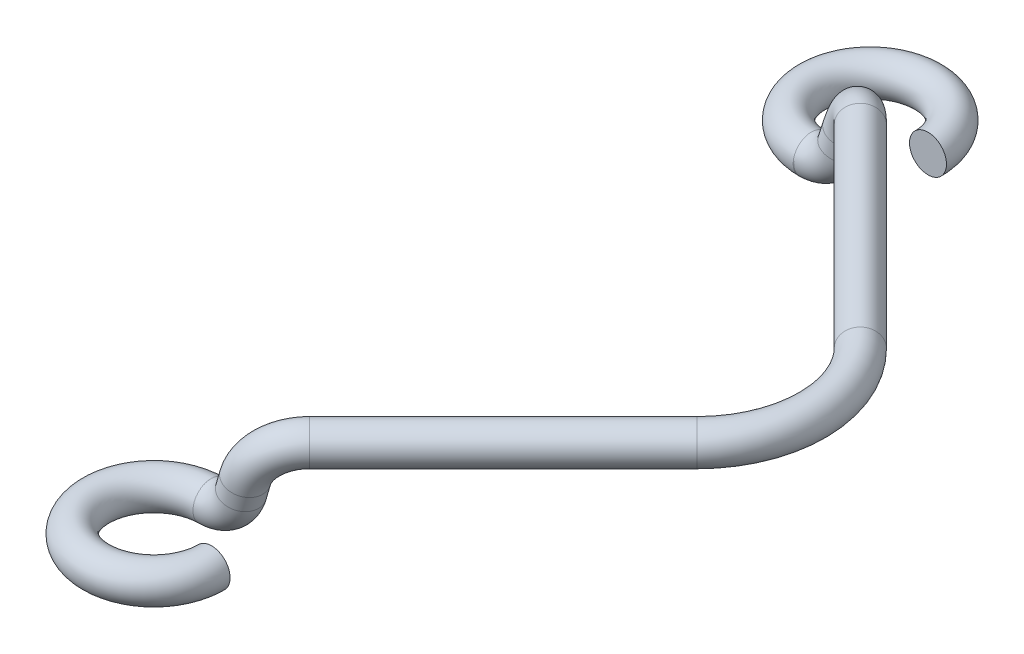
ISO-10303-21;
HEADER;
FILE_DESCRIPTION(('STEP AP214'),'2;1');
FILE_NAME('part.step','',(''),(''),'','','');
FILE_SCHEMA(('AUTOMOTIVE_DESIGN { 1 0 10303 214 1 1 1 1 }'));
ENDSEC;
DATA;
#1=APPLICATION_CONTEXT('core data for automotive mechanical design processes');
#2=APPLICATION_PROTOCOL_DEFINITION('international standard','automotive_design',2000,#1);
#3=PRODUCT_CONTEXT('',#1,'mechanical');
#4=PRODUCT('Part','Part','',(#3));
#5=PRODUCT_RELATED_PRODUCT_CATEGORY('part','',(#4));
#6=PRODUCT_DEFINITION_FORMATION('','',#4);
#7=PRODUCT_DEFINITION_CONTEXT('part definition',#1,'design');
#8=PRODUCT_DEFINITION('design','',#6,#7);
#9=PRODUCT_DEFINITION_SHAPE('','',#8);
#10=(LENGTH_UNIT() NAMED_UNIT(*) SI_UNIT(.MILLI.,.METRE.));
#11=(NAMED_UNIT(*) PLANE_ANGLE_UNIT() SI_UNIT($,.RADIAN.));
#12=(NAMED_UNIT(*) SI_UNIT($,.STERADIAN.) SOLID_ANGLE_UNIT());
#13=UNCERTAINTY_MEASURE_WITH_UNIT(LENGTH_MEASURE(1.E-05),#10,'distance_accuracy_value','');
#14=(GEOMETRIC_REPRESENTATION_CONTEXT(3) GLOBAL_UNCERTAINTY_ASSIGNED_CONTEXT((#13)) GLOBAL_UNIT_ASSIGNED_CONTEXT((#10,
#11,#12)) REPRESENTATION_CONTEXT('',''));
#15=CARTESIAN_POINT('',(0.,0.,0.));
#16=DIRECTION('',(0.,0.,1.));
#17=DIRECTION('',(1.,0.,0.));
#18=AXIS2_PLACEMENT_3D('',#15,#16,#17);
#19=CARTESIAN_POINT('',(-13.5,-1.60000000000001,-15.4999999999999));
#20=DIRECTION('',(0.,0.,1.));
#21=DIRECTION('',(1.,0.,0.));
#22=AXIS2_PLACEMENT_3D('',#19,#20,#21);
#23=PLANE('',#22);
#24=CARTESIAN_POINT('',(-14.3,-1.60000000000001,-15.5));
#25=CARTESIAN_POINT('',(-14.2999963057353,-1.5550895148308,-15.5));
#26=CARTESIAN_POINT('',(-14.2962042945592,-1.51013827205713,-15.5));
#27=CARTESIAN_POINT('',(-14.2811184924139,-1.42143511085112,-15.5));
#28=CARTESIAN_POINT('',(-14.2698086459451,-1.37768596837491,-15.5));
#29=CARTESIAN_POINT('',(-14.2400135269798,-1.29275099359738,-15.5));
#30=CARTESIAN_POINT('',(-14.2215360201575,-1.25156244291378,-15.5));
#31=CARTESIAN_POINT('',(-14.1779278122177,-1.17287261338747,-15.4999999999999));
#32=CARTESIAN_POINT('',(-14.1527969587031,-1.13537141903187,-15.4999999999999));
#33=CARTESIAN_POINT('',(-14.0965975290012,-1.0651219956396,-15.4999999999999));
#34=CARTESIAN_POINT('',(-14.0655292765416,-1.03237350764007,-15.4999999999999));
#35=CARTESIAN_POINT('',(-13.9983330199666,-0.972554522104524,-15.4999999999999));
#36=CARTESIAN_POINT('',(-13.9622045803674,-0.945484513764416,-15.4999999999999));
#37=CARTESIAN_POINT('',(-13.8859171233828,-0.897795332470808,-15.4999999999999));
#38=CARTESIAN_POINT('',(-13.8457582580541,-0.877175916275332,-15.4999999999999));
#39=CARTESIAN_POINT('',(-13.762549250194,-0.842972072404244,-15.4999999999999));
#40=CARTESIAN_POINT('',(-13.7194991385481,-0.829387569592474,-15.4999999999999));
#41=CARTESIAN_POINT('',(-13.6317290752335,-0.809638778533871,-15.4999999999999));
#42=CARTESIAN_POINT('',(-13.5870091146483,-0.803474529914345,-15.4999999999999));
#43=CARTESIAN_POINT('',(-13.4971690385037,-0.798741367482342,-15.4999999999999));
#44=CARTESIAN_POINT('',(-13.4520489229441,-0.800172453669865,-15.4999999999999));
#45=CARTESIAN_POINT('',(-13.3626896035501,-0.810589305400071,-15.4999999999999));
#46=CARTESIAN_POINT('',(-13.3184503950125,-0.819575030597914,-15.4999999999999));
#47=CARTESIAN_POINT('',(-13.2321079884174,-0.84484617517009,-15.4999999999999));
#48=CARTESIAN_POINT('',(-13.1900048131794,-0.861131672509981,-15.4999999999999));
#49=CARTESIAN_POINT('',(-13.10912864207,-0.900540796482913,-15.4999999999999));
#50=CARTESIAN_POINT('',(-13.0703557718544,-0.923664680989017,-15.4999999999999));
#51=CARTESIAN_POINT('',(-12.9972459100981,-0.976091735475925,-15.4999999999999));
#52=CARTESIAN_POINT('',(-12.9629085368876,-1.00539437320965,-15.4999999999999));
#53=CARTESIAN_POINT('',(-12.8996386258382,-1.06934963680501,-15.4999999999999));
#54=CARTESIAN_POINT('',(-12.8707063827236,-1.10400255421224,-15.4999999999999));
#55=CARTESIAN_POINT('',(-12.8190710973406,-1.17767454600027,-15.4999999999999));
#56=CARTESIAN_POINT('',(-12.7963679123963,-1.21669352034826,-15.4999999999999));
#57=CARTESIAN_POINT('',(-12.757813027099,-1.29802752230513,-15.4999999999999));
#58=CARTESIAN_POINT('',(-12.7419687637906,-1.34034606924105,-15.4999999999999));
#59=CARTESIAN_POINT('',(-12.7176458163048,-1.42697300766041,-15.4999999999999));
#60=CARTESIAN_POINT('',(-12.7091514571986,-1.47127695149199,-15.4999999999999));
#61=CARTESIAN_POINT('',(-12.7014761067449,-1.54386047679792,-15.4999999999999));
#62=CARTESIAN_POINT('',(-12.6999976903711,-1.57192227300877,-15.4999999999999));
#63=CARTESIAN_POINT('',(-12.7000036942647,-1.64491048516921,-15.4999999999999));
#64=CARTESIAN_POINT('',(-12.7037957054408,-1.68986172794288,-15.4999999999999));
#65=CARTESIAN_POINT('',(-12.7188815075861,-1.77856488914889,-15.4999999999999));
#66=CARTESIAN_POINT('',(-12.7301913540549,-1.8223140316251,-15.4999999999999));
#67=CARTESIAN_POINT('',(-12.7599864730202,-1.90724900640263,-15.4999999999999));
#68=CARTESIAN_POINT('',(-12.7784639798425,-1.94843755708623,-15.4999999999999));
#69=CARTESIAN_POINT('',(-12.8220721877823,-2.02712738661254,-15.4999999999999));
#70=CARTESIAN_POINT('',(-12.8472030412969,-2.06462858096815,-15.4999999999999));
#71=CARTESIAN_POINT('',(-12.9034024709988,-2.13487800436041,-15.4999999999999));
#72=CARTESIAN_POINT('',(-12.9344707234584,-2.16762649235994,-15.4999999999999));
#73=CARTESIAN_POINT('',(-13.0016669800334,-2.22744547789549,-15.4999999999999));
#74=CARTESIAN_POINT('',(-13.0377954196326,-2.2545154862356,-15.4999999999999));
#75=CARTESIAN_POINT('',(-13.1140828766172,-2.3022046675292,-15.4999999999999));
#76=CARTESIAN_POINT('',(-13.1542417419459,-2.32282408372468,-15.4999999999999));
#77=CARTESIAN_POINT('',(-13.237450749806,-2.35702792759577,-15.4999999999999));
#78=CARTESIAN_POINT('',(-13.2805008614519,-2.37061243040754,-15.4999999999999));
#79=CARTESIAN_POINT('',(-13.3682709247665,-2.39036122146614,-15.4999999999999));
#80=CARTESIAN_POINT('',(-13.4129908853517,-2.39652547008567,-15.4999999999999));
#81=CARTESIAN_POINT('',(-13.5028309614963,-2.40125863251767,-15.4999999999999));
#82=CARTESIAN_POINT('',(-13.5479510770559,-2.39982754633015,-15.4999999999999));
#83=CARTESIAN_POINT('',(-13.6373103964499,-2.38941069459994,-15.4999999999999));
#84=CARTESIAN_POINT('',(-13.6815496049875,-2.3804249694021,-15.4999999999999));
#85=CARTESIAN_POINT('',(-13.7678920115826,-2.35515382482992,-15.4999999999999));
#86=CARTESIAN_POINT('',(-13.8099951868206,-2.33886832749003,-15.4999999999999));
#87=CARTESIAN_POINT('',(-13.89087135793,-2.2994592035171,-15.4999999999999));
#88=CARTESIAN_POINT('',(-13.9296442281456,-2.276335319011,-15.4999999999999));
#89=CARTESIAN_POINT('',(-14.0027540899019,-2.22390826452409,-15.4999999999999));
#90=CARTESIAN_POINT('',(-14.0370914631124,-2.19460562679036,-15.4999999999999));
#91=CARTESIAN_POINT('',(-14.1003613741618,-2.130650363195,-15.4999999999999));
#92=CARTESIAN_POINT('',(-14.1292936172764,-2.09599744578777,-15.4999999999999));
#93=CARTESIAN_POINT('',(-14.1809289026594,-2.02232545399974,-15.4999999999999));
#94=CARTESIAN_POINT('',(-14.2036320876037,-1.98330647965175,-15.4999999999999));
#95=CARTESIAN_POINT('',(-14.242186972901,-1.90197247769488,-15.4999999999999));
#96=CARTESIAN_POINT('',(-14.2580312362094,-1.85965393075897,-15.5));
#97=CARTESIAN_POINT('',(-14.2823541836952,-1.7730269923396,-15.5));
#98=CARTESIAN_POINT('',(-14.2908485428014,-1.72872304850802,-15.5));
#99=CARTESIAN_POINT('',(-14.2985238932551,-1.65613952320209,-15.5));
#100=CARTESIAN_POINT('',(-14.3000023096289,-1.62807772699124,-15.5));
#101=CARTESIAN_POINT('',(-14.3,-1.60000000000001,-15.5));
#102=B_SPLINE_CURVE_WITH_KNOTS('',3,(#24,#25,#26,#27,#28,#29,#30,#31,#32,#33,#34,#35,#36,#37,
#38,#39,#40,#41,#42,#43,#44,#45,#46,#47,#48,#49,#50,#51,#52,#53,#54,#55,#56,#57,#58,#59,#60,#61,
#62,#63,#64,#65,#66,#67,#68,#69,#70,#71,#72,#73,#74,#75,#76,#77,#78,#79,#80,#81,#82,#83,#84,#85,
#86,#87,#88,#89,#90,#91,#92,#93,#94,#95,#96,#97,#98,#99,#100,#101),.UNSPECIFIED.,.T.,.F.,(4,2,2,
2,2,2,2,2,2,2,2,2,2,2,2,2,2,2,2,2,2,2,2,2,2,2,2,2,2,2,2,2,2,2,2,2,2,2,4),(0.,0.134643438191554,
0.269575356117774,0.404361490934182,0.539150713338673,0.673932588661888,0.808726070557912,
0.943514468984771,1.07830142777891,1.21308910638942,1.34787678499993,1.48266374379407,
1.61745214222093,1.75224562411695,1.88702749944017,2.02181672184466,2.15660285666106,
2.29153477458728,2.42617821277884,2.51035636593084,2.64499980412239,2.77993172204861,
2.91471785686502,3.04950707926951,3.18428895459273,3.31908243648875,3.45387083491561,
3.58865779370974,3.72344547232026,3.85823315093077,3.99302010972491,4.12780850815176,
4.26260199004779,4.397383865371,4.53217308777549,4.6669592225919,4.80189114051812,
4.93653457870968,5.02071273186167),.UNSPECIFIED.);
#103=CARTESIAN_POINT('',(-14.3,-1.60000000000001,-15.5));
#104=VERTEX_POINT('',#103);
#105=EDGE_CURVE('E19',#104,#104,#102,.T.);
#106=ORIENTED_EDGE('',*,*,#105,.F.);
#107=EDGE_LOOP('',(#106));
#108=FACE_BOUND('',#107,.T.);
#109=ADVANCED_FACE('F15',(#108),#23,.T.);
#110=CARTESIAN_POINT('',(-13.5,-1.6,15.5));
#111=DIRECTION('',(0.,0.,1.));
#112=DIRECTION('',(1.,0.,0.));
#113=AXIS2_PLACEMENT_3D('',#110,#111,#112);
#114=PLANE('',#113);
#115=CARTESIAN_POINT('',(-12.7,-1.6,15.5));
#116=CARTESIAN_POINT('',(-12.7000036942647,-1.5550895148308,15.5));
#117=CARTESIAN_POINT('',(-12.7037957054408,-1.51013827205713,15.5));
#118=CARTESIAN_POINT('',(-12.7188815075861,-1.42143511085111,15.5));
#119=CARTESIAN_POINT('',(-12.7301913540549,-1.37768596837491,15.5));
#120=CARTESIAN_POINT('',(-12.7599864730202,-1.29275099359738,15.5));
#121=CARTESIAN_POINT('',(-12.7784639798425,-1.25156244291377,15.5));
#122=CARTESIAN_POINT('',(-12.8220721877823,-1.17287261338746,15.5));
#123=CARTESIAN_POINT('',(-12.8472030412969,-1.13537141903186,15.5));
#124=CARTESIAN_POINT('',(-12.9034024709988,-1.0651219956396,15.5));
#125=CARTESIAN_POINT('',(-12.9344707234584,-1.03237350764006,15.5));
#126=CARTESIAN_POINT('',(-13.0016669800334,-0.972554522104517,15.5));
#127=CARTESIAN_POINT('',(-13.0377954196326,-0.945484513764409,15.5));
#128=CARTESIAN_POINT('',(-13.1140828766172,-0.897795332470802,15.5));
#129=CARTESIAN_POINT('',(-13.1542417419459,-0.877175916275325,15.5));
#130=CARTESIAN_POINT('',(-13.237450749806,-0.842972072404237,15.5));
#131=CARTESIAN_POINT('',(-13.2805008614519,-0.829387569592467,15.5));
#132=CARTESIAN_POINT('',(-13.3682709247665,-0.809638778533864,15.5));
#133=CARTESIAN_POINT('',(-13.4129908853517,-0.803474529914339,15.5));
#134=CARTESIAN_POINT('',(-13.5028309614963,-0.798741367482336,15.5));
#135=CARTESIAN_POINT('',(-13.5479510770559,-0.80017245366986,15.5));
#136=CARTESIAN_POINT('',(-13.6373103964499,-0.810589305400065,15.5));
#137=CARTESIAN_POINT('',(-13.6815496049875,-0.819575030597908,15.5));
#138=CARTESIAN_POINT('',(-13.7678920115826,-0.844846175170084,15.5));
#139=CARTESIAN_POINT('',(-13.8099951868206,-0.861131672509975,15.5));
#140=CARTESIAN_POINT('',(-13.89087135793,-0.900540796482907,15.5));
#141=CARTESIAN_POINT('',(-13.9296442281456,-0.92366468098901,15.5));
#142=CARTESIAN_POINT('',(-14.0027540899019,-0.976091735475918,15.5));
#143=CARTESIAN_POINT('',(-14.0370914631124,-1.00539437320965,15.5));
#144=CARTESIAN_POINT('',(-14.1003613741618,-1.06934963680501,15.5));
#145=CARTESIAN_POINT('',(-14.1292936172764,-1.10400255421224,15.5));
#146=CARTESIAN_POINT('',(-14.1809289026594,-1.17767454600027,15.5));
#147=CARTESIAN_POINT('',(-14.2036320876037,-1.21669352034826,15.5));
#148=CARTESIAN_POINT('',(-14.242186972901,-1.29802752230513,15.5));
#149=CARTESIAN_POINT('',(-14.2580312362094,-1.34034606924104,15.5));
#150=CARTESIAN_POINT('',(-14.2823541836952,-1.42697300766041,15.5));
#151=CARTESIAN_POINT('',(-14.2908485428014,-1.47127695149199,15.5));
#152=CARTESIAN_POINT('',(-14.2985238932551,-1.54386047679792,15.5));
#153=CARTESIAN_POINT('',(-14.3000023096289,-1.57192227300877,15.5));
#154=CARTESIAN_POINT('',(-14.2999963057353,-1.6449104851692,15.5));
#155=CARTESIAN_POINT('',(-14.2962042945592,-1.68986172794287,15.5));
#156=CARTESIAN_POINT('',(-14.2811184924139,-1.77856488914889,15.5));
#157=CARTESIAN_POINT('',(-14.2698086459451,-1.82231403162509,15.5));
#158=CARTESIAN_POINT('',(-14.2400135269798,-1.90724900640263,15.5));
#159=CARTESIAN_POINT('',(-14.2215360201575,-1.94843755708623,15.5));
#160=CARTESIAN_POINT('',(-14.1779278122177,-2.02712738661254,15.5));
#161=CARTESIAN_POINT('',(-14.1527969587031,-2.06462858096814,15.5));
#162=CARTESIAN_POINT('',(-14.0965975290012,-2.1348780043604,15.5));
#163=CARTESIAN_POINT('',(-14.0655292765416,-2.16762649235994,15.5));
#164=CARTESIAN_POINT('',(-13.9983330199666,-2.22744547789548,15.5));
#165=CARTESIAN_POINT('',(-13.9622045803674,-2.25451548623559,15.5));
#166=CARTESIAN_POINT('',(-13.8859171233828,-2.3022046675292,15.5));
#167=CARTESIAN_POINT('',(-13.8457582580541,-2.32282408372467,15.5));
#168=CARTESIAN_POINT('',(-13.762549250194,-2.35702792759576,15.5));
#169=CARTESIAN_POINT('',(-13.7194991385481,-2.37061243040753,15.5));
#170=CARTESIAN_POINT('',(-13.6317290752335,-2.39036122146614,15.5));
#171=CARTESIAN_POINT('',(-13.5870091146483,-2.39652547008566,15.5));
#172=CARTESIAN_POINT('',(-13.4971690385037,-2.40125863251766,15.5));
#173=CARTESIAN_POINT('',(-13.4520489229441,-2.39982754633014,15.5));
#174=CARTESIAN_POINT('',(-13.3626896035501,-2.38941069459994,15.5));
#175=CARTESIAN_POINT('',(-13.3184503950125,-2.38042496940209,15.5));
#176=CARTESIAN_POINT('',(-13.2321079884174,-2.35515382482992,15.5));
#177=CARTESIAN_POINT('',(-13.1900048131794,-2.33886832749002,15.5));
#178=CARTESIAN_POINT('',(-13.10912864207,-2.29945920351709,15.5));
#179=CARTESIAN_POINT('',(-13.0703557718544,-2.27633531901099,15.5));
#180=CARTESIAN_POINT('',(-12.9972459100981,-2.22390826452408,15.5));
#181=CARTESIAN_POINT('',(-12.9629085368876,-2.19460562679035,15.5));
#182=CARTESIAN_POINT('',(-12.8996386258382,-2.13065036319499,15.5));
#183=CARTESIAN_POINT('',(-12.8707063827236,-2.09599744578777,15.5));
#184=CARTESIAN_POINT('',(-12.8190710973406,-2.02232545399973,15.5));
#185=CARTESIAN_POINT('',(-12.7963679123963,-1.98330647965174,15.5));
#186=CARTESIAN_POINT('',(-12.757813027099,-1.90197247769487,15.5));
#187=CARTESIAN_POINT('',(-12.7419687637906,-1.85965393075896,15.5));
#188=CARTESIAN_POINT('',(-12.7176458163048,-1.77302699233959,15.5));
#189=CARTESIAN_POINT('',(-12.7091514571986,-1.72872304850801,15.5));
#190=CARTESIAN_POINT('',(-12.7014761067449,-1.65613952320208,15.5));
#191=CARTESIAN_POINT('',(-12.6999976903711,-1.62807772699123,15.5));
#192=CARTESIAN_POINT('',(-12.7,-1.6,15.5));
#193=B_SPLINE_CURVE_WITH_KNOTS('',3,(#115,#116,#117,#118,#119,#120,#121,#122,#123,#124,#125,
#126,#127,#128,#129,#130,#131,#132,#133,#134,#135,#136,#137,#138,#139,#140,#141,#142,#143,#144,
#145,#146,#147,#148,#149,#150,#151,#152,#153,#154,#155,#156,#157,#158,#159,#160,#161,#162,#163,
#164,#165,#166,#167,#168,#169,#170,#171,#172,#173,#174,#175,#176,#177,#178,#179,#180,#181,#182,
#183,#184,#185,#186,#187,#188,#189,#190,#191,#192),.UNSPECIFIED.,.T.,.F.,(4,2,2,2,2,2,2,2,2,2,2,
2,2,2,2,2,2,2,2,2,2,2,2,2,2,2,2,2,2,2,2,2,2,2,2,2,2,2,4),(0.,0.134643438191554,
0.269575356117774,0.404361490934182,0.539150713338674,0.673932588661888,0.808726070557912,
0.943514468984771,1.07830142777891,1.21308910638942,1.34787678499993,1.48266374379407,
1.61745214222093,1.75224562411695,1.88702749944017,2.02181672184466,2.15660285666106,
2.29153477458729,2.42617821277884,2.51035636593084,2.64499980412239,2.77993172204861,
2.91471785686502,3.04950707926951,3.18428895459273,3.31908243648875,3.45387083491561,
3.58865779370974,3.72344547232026,3.85823315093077,3.99302010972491,4.12780850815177,
4.26260199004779,4.397383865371,4.53217308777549,4.6669592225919,4.80189114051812,
4.93653457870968,5.02071273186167),.UNSPECIFIED.);
#194=CARTESIAN_POINT('',(-12.7,-1.6,15.5));
#195=VERTEX_POINT('',#194);
#196=EDGE_CURVE('E113',#195,#195,#193,.T.);
#197=ORIENTED_EDGE('',*,*,#196,.F.);
#198=EDGE_LOOP('',(#197));
#199=FACE_BOUND('',#198,.T.);
#200=ADVANCED_FACE('F121',(#199),#114,.F.);
#201=CARTESIAN_POINT('',(-16.,-1.60000000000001,-15.5));
#202=DIRECTION('',(0.,-1.,0.));
#203=DIRECTION('',(0.,0.,-1.));
#204=AXIS2_PLACEMENT_3D('',#201,#202,#203);
#205=TOROIDAL_SURFACE('',#204,2.5,0.799999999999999);
#206=CARTESIAN_POINT('',(-16.,-1.60000000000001,-13.));
#207=DIRECTION('',(1.,0.,0.));
#208=DIRECTION('',(0.,0.,-1.));
#209=AXIS2_PLACEMENT_3D('',#206,#207,#208);
#210=CIRCLE('',#209,0.799999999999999);
#211=CARTESIAN_POINT('',(-16.,-1.60000000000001,-13.8));
#212=VERTEX_POINT('',#211);
#213=EDGE_CURVE('E110',#212,#212,#210,.F.);
#214=ORIENTED_EDGE('',*,*,#213,.T.);
#215=EDGE_LOOP('',(#214));
#216=FACE_BOUND('',#215,.T.);
#217=ORIENTED_EDGE('',*,*,#105,.T.);
#218=EDGE_LOOP('',(#217));
#219=FACE_BOUND('',#218,.T.);
#220=ADVANCED_FACE('F118',(#216,#219),#205,.T.);
#221=CARTESIAN_POINT('',(-16.0342988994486,-1.60000000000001,-13.));
#222=DIRECTION('',(1.,0.,0.));
#223=DIRECTION('',(0.,0.,-1.));
#224=AXIS2_PLACEMENT_3D('',#221,#222,#223);
#225=CYLINDRICAL_SURFACE('',#224,0.799999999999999);
#226=ORIENTED_EDGE('',*,*,#213,.F.);
#227=EDGE_LOOP('',(#226));
#228=FACE_BOUND('',#227,.T.);
#229=CARTESIAN_POINT('',(-16.0342988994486,-1.6,-13.));
#230=DIRECTION('',(-1.,0.,0.));
#231=DIRECTION('',(0.,-0.999630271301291,0.0271904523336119));
#232=AXIS2_PLACEMENT_3D('',#229,#230,#231);
#233=CIRCLE('',#232,0.799999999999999);
#234=CARTESIAN_POINT('',(-16.0342988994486,-2.39970421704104,-12.9782476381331));
#235=VERTEX_POINT('',#234);
#236=EDGE_CURVE('E109',#235,#235,#233,.F.);
#237=ORIENTED_EDGE('',*,*,#236,.F.);
#238=EDGE_LOOP('',(#237));
#239=FACE_BOUND('',#238,.T.);
#240=ADVANCED_FACE('F105',(#228,#239),#225,.F.);
#241=CARTESIAN_POINT('',(-16.,-1.6,15.5));
#242=DIRECTION('',(0.,1.,0.));
#243=DIRECTION('',(0.,0.,1.));
#244=AXIS2_PLACEMENT_3D('',#241,#242,#243);
#245=TOROIDAL_SURFACE('',#244,2.5,0.799999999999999);
#246=ORIENTED_EDGE('',*,*,#196,.T.);
#247=EDGE_LOOP('',(#246));
#248=FACE_BOUND('',#247,.T.);
#249=CARTESIAN_POINT('',(-15.9999999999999,-1.6,13.));
#250=DIRECTION('',(-1.,0.,0.));
#251=DIRECTION('',(0.,0.,1.));
#252=AXIS2_PLACEMENT_3D('',#249,#250,#251);
#253=CIRCLE('',#252,0.799999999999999);
#254=CARTESIAN_POINT('',(-16.,-1.6,13.8));
#255=VERTEX_POINT('',#254);
#256=EDGE_CURVE('E88',#255,#255,#253,.T.);
#257=ORIENTED_EDGE('',*,*,#256,.T.);
#258=EDGE_LOOP('',(#257));
#259=FACE_BOUND('',#258,.T.);
#260=ADVANCED_FACE('F99',(#248,#259),#245,.T.);
#261=CARTESIAN_POINT('',(-16.,-1.6,13.));
#262=DIRECTION('',(-1.,0.,0.));
#263=DIRECTION('',(0.,0.,1.));
#264=AXIS2_PLACEMENT_3D('',#261,#262,#263);
#265=CYLINDRICAL_SURFACE('',#264,0.799999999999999);
#266=CARTESIAN_POINT('',(-16.0342988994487,-1.6,13.));
#267=DIRECTION('',(1.,0.,0.));
#268=DIRECTION('',(0.,-0.999630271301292,-0.0271904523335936));
#269=AXIS2_PLACEMENT_3D('',#266,#267,#268);
#270=CIRCLE('',#269,0.799999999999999);
#271=CARTESIAN_POINT('',(-16.0342988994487,-2.39970421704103,12.9782476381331));
#272=VERTEX_POINT('',#271);
#273=EDGE_CURVE('E85',#272,#272,#270,.T.);
#274=ORIENTED_EDGE('',*,*,#273,.F.);
#275=EDGE_LOOP('',(#274));
#276=FACE_BOUND('',#275,.T.);
#277=ORIENTED_EDGE('',*,*,#256,.F.);
#278=EDGE_LOOP('',(#277));
#279=FACE_BOUND('',#278,.T.);
#280=ADVANCED_FACE('F95',(#276,#279),#265,.F.);
#281=CARTESIAN_POINT('',(-16.0342988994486,-0.200517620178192,-13.0380666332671));
#282=DIRECTION('',(0.,-0.0271904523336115,-0.999630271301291));
#283=DIRECTION('',(0.,0.999630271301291,-0.0271904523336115));
#284=AXIS2_PLACEMENT_3D('',#281,#282,#283);
#285=TOROIDAL_SURFACE('',#284,1.4,0.799999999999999);
#286=CARTESIAN_POINT('',(-14.6960963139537,-0.611721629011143,-13.0268816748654));
#287=DIRECTION('',(-0.293825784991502,-0.955505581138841,0.0259902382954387));
#288=DIRECTION('',(0.955828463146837,-0.293925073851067,0.));
#289=AXIS2_PLACEMENT_3D('',#286,#287,#288);
#290=CIRCLE('',#289,0.799999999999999);
#291=CARTESIAN_POINT('',(-13.9314335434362,-0.846861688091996,-13.0268816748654));
#292=VERTEX_POINT('',#291);
#293=EDGE_CURVE('E82',#292,#292,#290,.F.);
#294=ORIENTED_EDGE('',*,*,#293,.F.);
#295=EDGE_LOOP('',(#294));
#296=FACE_BOUND('',#295,.T.);
#297=ORIENTED_EDGE('',*,*,#236,.T.);
#298=EDGE_LOOP('',(#297));
#299=FACE_BOUND('',#298,.T.);
#300=ADVANCED_FACE('F92',(#296,#299),#285,.T.);
#301=CARTESIAN_POINT('',(-14.5011109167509,0.0223603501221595,-13.0441290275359));
#302=DIRECTION('',(-0.293825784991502,-0.955505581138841,0.0259902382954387));
#303=DIRECTION('',(0.955828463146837,-0.293925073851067,0.));
#304=AXIS2_PLACEMENT_3D('',#301,#302,#303);
#305=CYLINDRICAL_SURFACE('',#304,0.799999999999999);
#306=CARTESIAN_POINT('',(-14.5011109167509,0.0223603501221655,-13.0441290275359));
#307=DIRECTION('',(-0.293825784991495,-0.955505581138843,0.0259902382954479));
#308=DIRECTION('',(-0.663466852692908,0.184296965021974,-0.725152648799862));
#309=AXIS2_PLACEMENT_3D('',#306,#307,#308);
#310=CIRCLE('',#309,0.799999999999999);
#311=CARTESIAN_POINT('',(-15.0318843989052,0.169797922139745,-13.6242511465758));
#312=VERTEX_POINT('',#311);
#313=EDGE_CURVE('E66',#312,#312,#310,.F.);
#314=ORIENTED_EDGE('',*,*,#313,.F.);
#315=EDGE_LOOP('',(#314));
#316=FACE_BOUND('',#315,.T.);
#317=ORIENTED_EDGE('',*,*,#293,.T.);
#318=EDGE_LOOP('',(#317));
#319=FACE_BOUND('',#318,.T.);
#320=ADVANCED_FACE('F77',(#316,#319),#305,.T.);
#321=CARTESIAN_POINT('',(-16.0342988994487,-0.200517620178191,13.038066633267));
#322=DIRECTION('',(0.,-0.0271904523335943,0.999630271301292));
#323=DIRECTION('',(0.,-0.999630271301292,-0.0271904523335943));
#324=AXIS2_PLACEMENT_3D('',#321,#322,#323);
#325=TOROIDAL_SURFACE('',#324,1.4,0.799999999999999);
#326=CARTESIAN_POINT('',(-14.6960963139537,-0.611721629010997,13.0268816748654));
#327=DIRECTION('',(0.293825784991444,0.955505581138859,0.0259902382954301));
#328=DIRECTION('',(-0.955828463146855,0.293925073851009,0.));
#329=AXIS2_PLACEMENT_3D('',#326,#327,#328);
#330=CIRCLE('',#329,0.799999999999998);
#331=CARTESIAN_POINT('',(-15.4607590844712,-0.37658156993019,13.0268816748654));
#332=VERTEX_POINT('',#331);
#333=EDGE_CURVE('E63',#332,#332,#330,.T.);
#334=ORIENTED_EDGE('',*,*,#333,.F.);
#335=EDGE_LOOP('',(#334));
#336=FACE_BOUND('',#335,.T.);
#337=ORIENTED_EDGE('',*,*,#273,.T.);
#338=EDGE_LOOP('',(#337));
#339=FACE_BOUND('',#338,.T.);
#340=ADVANCED_FACE('F73',(#336,#339),#325,.T.);
#341=CARTESIAN_POINT('',(-13.1741772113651,-0.346233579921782,-11.5938237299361));
#342=DIRECTION('',(-0.688097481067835,0.230312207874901,0.688097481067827));
#343=DIRECTION('',(0.707106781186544,0.,0.707106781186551));
#344=AXIS2_PLACEMENT_3D('',#341,#342,#343);
#345=TOROIDAL_SURFACE('',#344,2.,0.799999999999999);
#346=ORIENTED_EDGE('',*,*,#313,.T.);
#347=EDGE_LOOP('',(#346));
#348=FACE_BOUND('',#347,.T.);
#349=CARTESIAN_POINT('',(-12.8484665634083,1.6,-11.9195343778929));
#350=DIRECTION('',(-0.707106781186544,0.,-0.707106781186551));
#351=DIRECTION('',(-0.707106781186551,0.,0.707106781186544));
#352=AXIS2_PLACEMENT_3D('',#349,#350,#351);
#353=CIRCLE('',#352,0.799999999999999);
#354=CARTESIAN_POINT('',(-13.4141519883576,1.6,-11.3538489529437));
#355=VERTEX_POINT('',#354);
#356=EDGE_CURVE('E60',#355,#355,#353,.F.);
#357=ORIENTED_EDGE('',*,*,#356,.F.);
#358=EDGE_LOOP('',(#357));
#359=FACE_BOUND('',#358,.T.);
#360=ADVANCED_FACE('F70',(#348,#359),#345,.T.);
#361=CARTESIAN_POINT('',(-14.6960963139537,-0.611721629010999,13.0268816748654));
#362=DIRECTION('',(0.293825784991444,0.955505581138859,0.0259902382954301));
#363=DIRECTION('',(-0.955828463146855,0.293925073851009,0.));
#364=AXIS2_PLACEMENT_3D('',#361,#362,#363);
#365=CYLINDRICAL_SURFACE('',#364,0.799999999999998);
#366=ORIENTED_EDGE('',*,*,#333,.T.);
#367=EDGE_LOOP('',(#366));
#368=FACE_BOUND('',#367,.T.);
#369=CARTESIAN_POINT('',(-14.501110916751,0.0223603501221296,13.0441290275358));
#370=DIRECTION('',(0.293825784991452,0.955505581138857,0.025990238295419));
#371=DIRECTION('',(-0.663466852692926,0.18429696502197,0.725152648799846));
#372=AXIS2_PLACEMENT_3D('',#369,#370,#371);
#373=CIRCLE('',#372,0.799999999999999);
#374=CARTESIAN_POINT('',(-15.0318843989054,0.169797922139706,13.6242511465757));
#375=VERTEX_POINT('',#374);
#376=EDGE_CURVE('E57',#375,#375,#373,.T.);
#377=ORIENTED_EDGE('',*,*,#376,.F.);
#378=EDGE_LOOP('',(#377));
#379=FACE_BOUND('',#378,.T.);
#380=ADVANCED_FACE('F52',(#368,#379),#365,.T.);
#381=CARTESIAN_POINT('',(-13.1741772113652,-0.34623357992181,11.5938237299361));
#382=DIRECTION('',(-0.688097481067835,0.230312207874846,-0.688097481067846));
#383=DIRECTION('',(-0.707106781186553,0.,0.707106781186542));
#384=AXIS2_PLACEMENT_3D('',#381,#382,#383);
#385=TOROIDAL_SURFACE('',#384,1.99999999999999,0.799999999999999);
#386=ORIENTED_EDGE('',*,*,#376,.T.);
#387=EDGE_LOOP('',(#386));
#388=FACE_BOUND('',#387,.T.);
#389=CARTESIAN_POINT('',(-12.8484665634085,1.6,11.9195343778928));
#390=DIRECTION('',(0.707106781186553,0.,-0.707106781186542));
#391=DIRECTION('',(-0.707106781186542,0.,-0.707106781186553));
#392=AXIS2_PLACEMENT_3D('',#389,#390,#391);
#393=CIRCLE('',#392,0.8);
#394=CARTESIAN_POINT('',(-13.4141519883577,1.6,11.3538489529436));
#395=VERTEX_POINT('',#394);
#396=EDGE_CURVE('E32',#395,#395,#393,.T.);
#397=ORIENTED_EDGE('',*,*,#396,.F.);
#398=EDGE_LOOP('',(#397));
#399=FACE_BOUND('',#398,.T.);
#400=ADVANCED_FACE('F47',(#388,#399),#385,.T.);
#401=CARTESIAN_POINT('',(-4.46446609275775,1.6,-3.53553390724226));
#402=DIRECTION('',(-0.707106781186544,0.,-0.707106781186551));
#403=DIRECTION('',(-0.707106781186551,0.,0.707106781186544));
#404=AXIS2_PLACEMENT_3D('',#401,#402,#403);
#405=CYLINDRICAL_SURFACE('',#404,0.799999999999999);
#406=CARTESIAN_POINT('',(-4.46446609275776,1.6,-3.53553390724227));
#407=DIRECTION('',(-0.707106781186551,0.,-0.707106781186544));
#408=DIRECTION('',(0.707106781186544,0.,-0.70710678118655));
#409=AXIS2_PLACEMENT_3D('',#406,#407,#408);
#410=CIRCLE('',#409,0.799999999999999);
#411=CARTESIAN_POINT('',(-3.89878066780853,1.6,-4.10121933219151));
#412=VERTEX_POINT('',#411);
#413=EDGE_CURVE('E27',#412,#412,#410,.F.);
#414=ORIENTED_EDGE('',*,*,#413,.F.);
#415=EDGE_LOOP('',(#414));
#416=FACE_BOUND('',#415,.T.);
#417=ORIENTED_EDGE('',*,*,#356,.T.);
#418=EDGE_LOOP('',(#417));
#419=FACE_BOUND('',#418,.T.);
#420=ADVANCED_FACE('F43',(#416,#419),#405,.T.);
#421=CARTESIAN_POINT('',(-8.,1.6,0.));
#422=DIRECTION('',(0.,1.,0.));
#423=DIRECTION('',(0.,0.,1.));
#424=AXIS2_PLACEMENT_3D('',#421,#422,#423);
#425=TOROIDAL_SURFACE('',#424,5.00000000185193,0.799999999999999);
#426=CARTESIAN_POINT('',(-4.46446609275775,1.6,3.53553390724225));
#427=DIRECTION('',(0.707106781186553,0.,-0.707106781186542));
#428=DIRECTION('',(-0.707106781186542,0.,-0.707106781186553));
#429=AXIS2_PLACEMENT_3D('',#426,#427,#428);
#430=CIRCLE('',#429,0.8);
#431=CARTESIAN_POINT('',(-5.03015151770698,1.6,2.96984848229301));
#432=VERTEX_POINT('',#431);
#433=EDGE_CURVE('E10',#432,#432,#430,.F.);
#434=ORIENTED_EDGE('',*,*,#433,.F.);
#435=EDGE_LOOP('',(#434));
#436=FACE_BOUND('',#435,.T.);
#437=ORIENTED_EDGE('',*,*,#413,.T.);
#438=EDGE_LOOP('',(#437));
#439=FACE_BOUND('',#438,.T.);
#440=ADVANCED_FACE('F38',(#436,#439),#425,.T.);
#441=CARTESIAN_POINT('',(-12.8484665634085,1.6,11.9195343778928));
#442=DIRECTION('',(0.707106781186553,0.,-0.707106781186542));
#443=DIRECTION('',(-0.707106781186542,0.,-0.707106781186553));
#444=AXIS2_PLACEMENT_3D('',#441,#442,#443);
#445=CYLINDRICAL_SURFACE('',#444,0.8);
#446=ORIENTED_EDGE('',*,*,#396,.T.);
#447=EDGE_LOOP('',(#446));
#448=FACE_BOUND('',#447,.T.);
#449=ORIENTED_EDGE('',*,*,#433,.T.);
#450=EDGE_LOOP('',(#449));
#451=FACE_BOUND('',#450,.T.);
#452=ADVANCED_FACE('F42',(#448,#451),#445,.T.);
#453=CLOSED_SHELL('',(#109,#200,#220,#240,#260,#280,#300,#320,#340,#360,#380,#400,#420,#440,#452));
#454=MANIFOLD_SOLID_BREP('B1',#453);
#455=ADVANCED_BREP_SHAPE_REPRESENTATION('',(#18,#454),#14);
#456=SHAPE_DEFINITION_REPRESENTATION(#9,#455);
ENDSEC;
END-ISO-10303-21;
